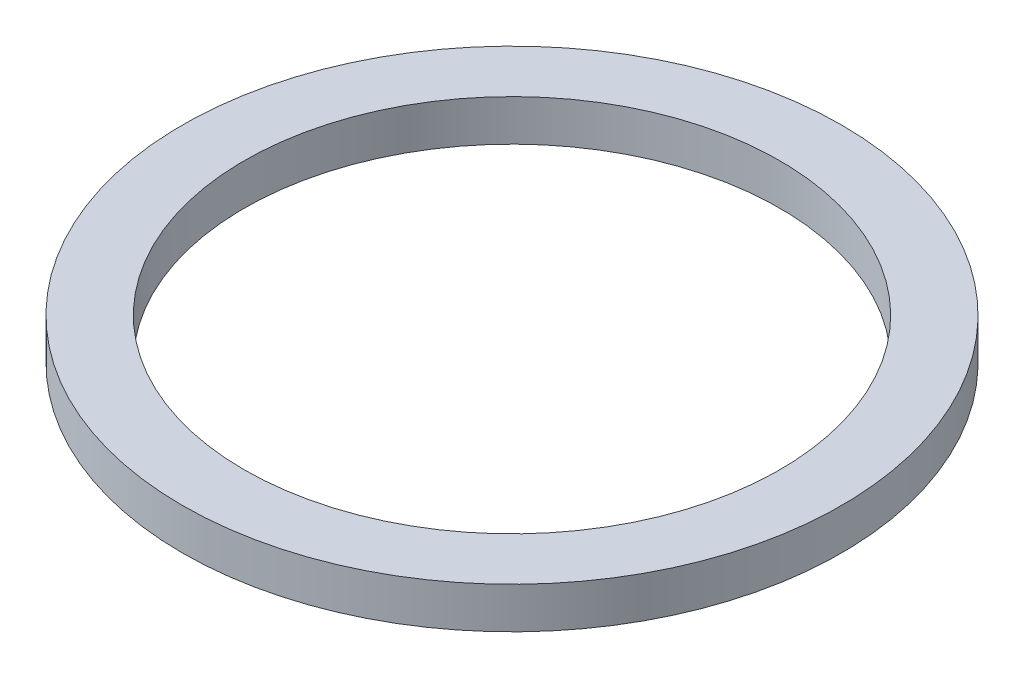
ISO-10303-21;
HEADER;
FILE_DESCRIPTION(('STEP AP214'),'2;1');
FILE_NAME('part.step','',(''),(''),'','','');
FILE_SCHEMA(('AUTOMOTIVE_DESIGN { 1 0 10303 214 1 1 1 1 }'));
ENDSEC;
DATA;
#1=APPLICATION_CONTEXT('core data for automotive mechanical design processes');
#2=APPLICATION_PROTOCOL_DEFINITION('international standard','automotive_design',2000,#1);
#3=PRODUCT_CONTEXT('',#1,'mechanical');
#4=PRODUCT('Part','Part','',(#3));
#5=PRODUCT_RELATED_PRODUCT_CATEGORY('part','',(#4));
#6=PRODUCT_DEFINITION_FORMATION('','',#4);
#7=PRODUCT_DEFINITION_CONTEXT('part definition',#1,'design');
#8=PRODUCT_DEFINITION('design','',#6,#7);
#9=PRODUCT_DEFINITION_SHAPE('','',#8);
#10=(LENGTH_UNIT() NAMED_UNIT(*) SI_UNIT(.MILLI.,.METRE.));
#11=(NAMED_UNIT(*) PLANE_ANGLE_UNIT() SI_UNIT($,.RADIAN.));
#12=(NAMED_UNIT(*) SI_UNIT($,.STERADIAN.) SOLID_ANGLE_UNIT());
#13=UNCERTAINTY_MEASURE_WITH_UNIT(LENGTH_MEASURE(1.E-05),#10,'distance_accuracy_value','');
#14=(GEOMETRIC_REPRESENTATION_CONTEXT(3) GLOBAL_UNCERTAINTY_ASSIGNED_CONTEXT((#13)) GLOBAL_UNIT_ASSIGNED_CONTEXT((#10,
#11,#12)) REPRESENTATION_CONTEXT('',''));
#15=CARTESIAN_POINT('',(0.,0.,0.));
#16=DIRECTION('',(0.,0.,1.));
#17=DIRECTION('',(1.,0.,0.));
#18=AXIS2_PLACEMENT_3D('',#15,#16,#17);
#19=CARTESIAN_POINT('',(0.,-2.,-13.));
#20=DIRECTION('',(0.,1.,0.));
#21=DIRECTION('',(0.,0.,1.));
#22=AXIS2_PLACEMENT_3D('',#19,#20,#21);
#23=PLANE('',#22);
#24=CARTESIAN_POINT('',(0.,-2.,0.));
#25=DIRECTION('',(0.,1.,0.));
#26=DIRECTION('',(0.,0.,1.));
#27=AXIS2_PLACEMENT_3D('',#24,#25,#26);
#28=CIRCLE('',#27,13.);
#29=CARTESIAN_POINT('',(0.,-2.,13.));
#30=VERTEX_POINT('',#29);
#31=EDGE_CURVE('E18',#30,#30,#28,.T.);
#32=ORIENTED_EDGE('',*,*,#31,.T.);
#33=EDGE_LOOP('',(#32));
#34=FACE_BOUND('',#33,.T.);
#35=CARTESIAN_POINT('',(0.,-2.,0.));
#36=DIRECTION('',(0.,1.,0.));
#37=DIRECTION('',(0.,0.,1.));
#38=AXIS2_PLACEMENT_3D('',#35,#36,#37);
#39=CIRCLE('',#38,16.);
#40=CARTESIAN_POINT('',(0.,-2.,16.));
#41=VERTEX_POINT('',#40);
#42=EDGE_CURVE('E27',#41,#41,#39,.T.);
#43=ORIENTED_EDGE('',*,*,#42,.F.);
#44=EDGE_LOOP('',(#43));
#45=FACE_BOUND('',#44,.T.);
#46=ADVANCED_FACE('F15',(#34,#45),#23,.F.);
#47=CARTESIAN_POINT('',(0.,-5.,0.));
#48=DIRECTION('',(0.,1.,0.));
#49=DIRECTION('',(0.,0.,1.));
#50=AXIS2_PLACEMENT_3D('',#47,#48,#49);
#51=CYLINDRICAL_SURFACE('',#50,13.);
#52=ORIENTED_EDGE('',*,*,#31,.F.);
#53=EDGE_LOOP('',(#52));
#54=FACE_BOUND('',#53,.T.);
#55=CARTESIAN_POINT('',(0.,0.,0.));
#56=DIRECTION('',(0.,1.,0.));
#57=DIRECTION('',(0.,0.,1.));
#58=AXIS2_PLACEMENT_3D('',#55,#56,#57);
#59=CIRCLE('',#58,13.);
#60=CARTESIAN_POINT('',(0.,0.,13.));
#61=VERTEX_POINT('',#60);
#62=EDGE_CURVE('E22',#61,#61,#59,.T.);
#63=ORIENTED_EDGE('',*,*,#62,.T.);
#64=EDGE_LOOP('',(#63));
#65=FACE_BOUND('',#64,.T.);
#66=ADVANCED_FACE('F37',(#54,#65),#51,.F.);
#67=CARTESIAN_POINT('',(0.,-5.,0.));
#68=DIRECTION('',(0.,1.,0.));
#69=DIRECTION('',(0.,0.,1.));
#70=AXIS2_PLACEMENT_3D('',#67,#68,#69);
#71=CYLINDRICAL_SURFACE('',#70,16.);
#72=CARTESIAN_POINT('',(0.,0.,0.));
#73=DIRECTION('',(0.,1.,0.));
#74=DIRECTION('',(0.,0.,1.));
#75=AXIS2_PLACEMENT_3D('',#72,#73,#74);
#76=CIRCLE('',#75,16.);
#77=CARTESIAN_POINT('',(0.,0.,16.));
#78=VERTEX_POINT('',#77);
#79=EDGE_CURVE('E10',#78,#78,#76,.F.);
#80=ORIENTED_EDGE('',*,*,#79,.T.);
#81=EDGE_LOOP('',(#80));
#82=FACE_BOUND('',#81,.T.);
#83=ORIENTED_EDGE('',*,*,#42,.T.);
#84=EDGE_LOOP('',(#83));
#85=FACE_BOUND('',#84,.T.);
#86=ADVANCED_FACE('F40',(#82,#85),#71,.T.);
#87=CARTESIAN_POINT('',(0.,0.,-16.));
#88=DIRECTION('',(0.,-1.,0.));
#89=DIRECTION('',(0.,0.,-1.));
#90=AXIS2_PLACEMENT_3D('',#87,#88,#89);
#91=PLANE('',#90);
#92=ORIENTED_EDGE('',*,*,#79,.F.);
#93=EDGE_LOOP('',(#92));
#94=FACE_BOUND('',#93,.T.);
#95=ORIENTED_EDGE('',*,*,#62,.F.);
#96=EDGE_LOOP('',(#95));
#97=FACE_BOUND('',#96,.T.);
#98=ADVANCED_FACE('F43',(#94,#97),#91,.F.);
#99=CLOSED_SHELL('',(#46,#66,#86,#98));
#100=MANIFOLD_SOLID_BREP('B1',#99);
#101=ADVANCED_BREP_SHAPE_REPRESENTATION('',(#18,#100),#14);
#102=SHAPE_DEFINITION_REPRESENTATION(#9,#101);
ENDSEC;
END-ISO-10303-21;
